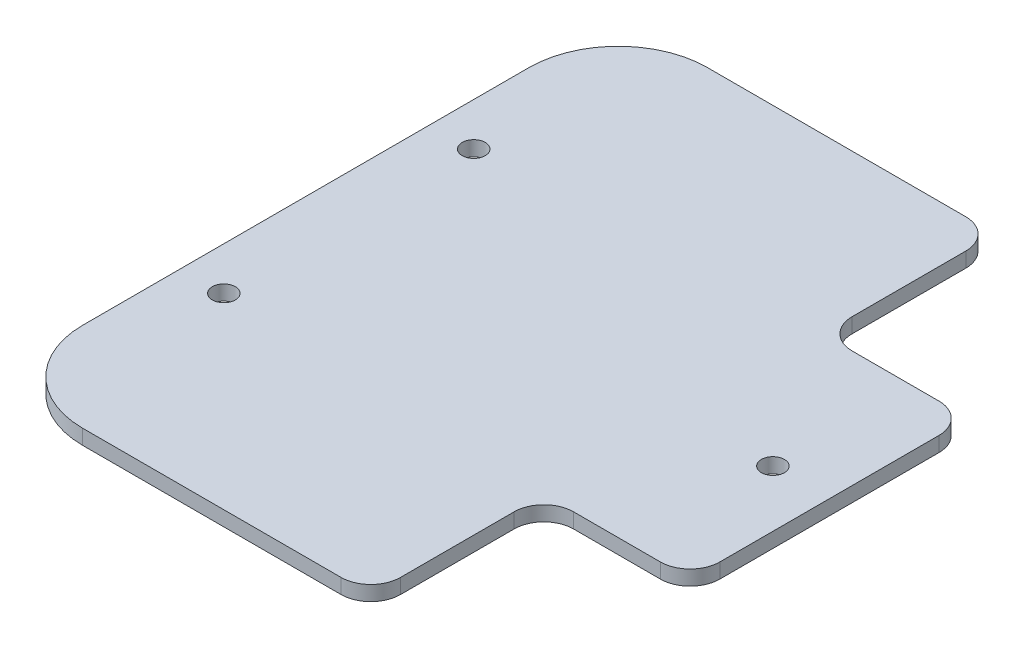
ISO-10303-21;
HEADER;
FILE_DESCRIPTION(('STEP AP214'),'2;1');
FILE_NAME('part.step','',(''),(''),'','','');
FILE_SCHEMA(('AUTOMOTIVE_DESIGN { 1 0 10303 214 1 1 1 1 }'));
ENDSEC;
DATA;
#1=APPLICATION_CONTEXT('core data for automotive mechanical design processes');
#2=APPLICATION_PROTOCOL_DEFINITION('international standard','automotive_design',2000,#1);
#3=PRODUCT_CONTEXT('',#1,'mechanical');
#4=PRODUCT('Part','Part','',(#3));
#5=PRODUCT_RELATED_PRODUCT_CATEGORY('part','',(#4));
#6=PRODUCT_DEFINITION_FORMATION('','',#4);
#7=PRODUCT_DEFINITION_CONTEXT('part definition',#1,'design');
#8=PRODUCT_DEFINITION('design','',#6,#7);
#9=PRODUCT_DEFINITION_SHAPE('','',#8);
#10=(LENGTH_UNIT() NAMED_UNIT(*) SI_UNIT(.MILLI.,.METRE.));
#11=(NAMED_UNIT(*) PLANE_ANGLE_UNIT() SI_UNIT($,.RADIAN.));
#12=(NAMED_UNIT(*) SI_UNIT($,.STERADIAN.) SOLID_ANGLE_UNIT());
#13=UNCERTAINTY_MEASURE_WITH_UNIT(LENGTH_MEASURE(1.E-05),#10,'distance_accuracy_value','');
#14=(GEOMETRIC_REPRESENTATION_CONTEXT(3) GLOBAL_UNCERTAINTY_ASSIGNED_CONTEXT((#13)) GLOBAL_UNIT_ASSIGNED_CONTEXT((#10,
#11,#12)) REPRESENTATION_CONTEXT('',''));
#15=CARTESIAN_POINT('',(0.,0.,0.));
#16=DIRECTION('',(0.,0.,1.));
#17=DIRECTION('',(1.,0.,0.));
#18=AXIS2_PLACEMENT_3D('',#15,#16,#17);
#19=CARTESIAN_POINT('',(54.61,3.175,-23.3854268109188));
#20=DIRECTION('',(0.,-1.,0.));
#21=DIRECTION('',(0.,0.,-1.));
#22=AXIS2_PLACEMENT_3D('',#19,#20,#21);
#23=CYLINDRICAL_SURFACE('',#22,6.35);
#24=CARTESIAN_POINT('',(54.61,0.,-23.3854268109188));
#25=DIRECTION('',(0.,1.,0.));
#26=DIRECTION('',(0.,0.,-1.));
#27=AXIS2_PLACEMENT_3D('',#24,#25,#26);
#28=CIRCLE('',#27,6.35);
#29=CARTESIAN_POINT('',(60.96,0.,-23.3854268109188));
#30=VERTEX_POINT('',#29);
#31=CARTESIAN_POINT('',(54.61,0.,-29.7354268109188));
#32=VERTEX_POINT('',#31);
#33=EDGE_CURVE('E177',#30,#32,#28,.T.);
#34=ORIENTED_EDGE('',*,*,#33,.T.);
#35=DIRECTION('',(0.,-1.,0.));
#36=VECTOR('',#35,1.);
#37=CARTESIAN_POINT('',(54.61,3.175,-29.7354268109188));
#38=LINE('',#37,#36);
#39=CARTESIAN_POINT('',(54.61,3.175,-29.7354268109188));
#40=VERTEX_POINT('',#39);
#41=EDGE_CURVE('E11',#40,#32,#38,.T.);
#42=ORIENTED_EDGE('',*,*,#41,.F.);
#43=CARTESIAN_POINT('',(54.61,3.175,-23.3854268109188));
#44=DIRECTION('',(0.,1.,0.));
#45=DIRECTION('',(0.,0.,-1.));
#46=AXIS2_PLACEMENT_3D('',#43,#44,#45);
#47=CIRCLE('',#46,6.35);
#48=CARTESIAN_POINT('',(60.96,3.175,-23.3854268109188));
#49=VERTEX_POINT('',#48);
#50=EDGE_CURVE('E208',#49,#40,#47,.T.);
#51=ORIENTED_EDGE('',*,*,#50,.F.);
#52=DIRECTION('',(0.,-1.,0.));
#53=VECTOR('',#52,1.);
#54=CARTESIAN_POINT('',(60.96,3.175,-23.3854268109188));
#55=LINE('',#54,#53);
#56=EDGE_CURVE('E173',#49,#30,#55,.T.);
#57=ORIENTED_EDGE('',*,*,#56,.T.);
#58=EDGE_LOOP('',(#34,#42,#51,#57));
#59=FACE_BOUND('',#58,.T.);
#60=ADVANCED_FACE('F33',(#59),#23,.T.);
#61=CARTESIAN_POINT('',(54.61,3.175,-29.7354268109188));
#62=DIRECTION('',(0.,0.,1.));
#63=DIRECTION('',(1.,0.,0.));
#64=AXIS2_PLACEMENT_3D('',#61,#62,#63);
#65=PLANE('',#64);
#66=DIRECTION('',(-1.,0.,0.));
#67=VECTOR('',#66,1.);
#68=CARTESIAN_POINT('',(54.61,0.,-29.7354268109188));
#69=LINE('',#68,#67);
#70=CARTESIAN_POINT('',(36.0854268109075,0.,-29.7354268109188));
#71=VERTEX_POINT('',#70);
#72=EDGE_CURVE('E180',#32,#71,#69,.T.);
#73=ORIENTED_EDGE('',*,*,#72,.T.);
#74=DIRECTION('',(0.,-1.,0.));
#75=VECTOR('',#74,1.);
#76=CARTESIAN_POINT('',(36.0854268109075,3.175,-29.7354268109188));
#77=LINE('',#76,#75);
#78=CARTESIAN_POINT('',(36.0854268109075,3.175,-29.7354268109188));
#79=VERTEX_POINT('',#78);
#80=EDGE_CURVE('E41',#79,#71,#77,.T.);
#81=ORIENTED_EDGE('',*,*,#80,.F.);
#82=DIRECTION('',(-1.,0.,0.));
#83=VECTOR('',#82,1.);
#84=CARTESIAN_POINT('',(54.61,3.175,-29.7354268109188));
#85=LINE('',#84,#83);
#86=EDGE_CURVE('E116',#40,#79,#85,.T.);
#87=ORIENTED_EDGE('',*,*,#86,.F.);
#88=ORIENTED_EDGE('',*,*,#41,.T.);
#89=EDGE_LOOP('',(#73,#81,#87,#88));
#90=FACE_BOUND('',#89,.T.);
#91=ADVANCED_FACE('F307',(#90),#65,.F.);
#92=CARTESIAN_POINT('',(36.0854268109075,3.175,-36.0854268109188));
#93=DIRECTION('',(0.,-1.,0.));
#94=DIRECTION('',(0.,0.,-1.));
#95=AXIS2_PLACEMENT_3D('',#92,#93,#94);
#96=CYLINDRICAL_SURFACE('',#95,6.34999999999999);
#97=CARTESIAN_POINT('',(36.0854268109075,0.,-36.0854268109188));
#98=DIRECTION('',(0.,-1.,0.));
#99=DIRECTION('',(0.,0.,1.));
#100=AXIS2_PLACEMENT_3D('',#97,#98,#99);
#101=CIRCLE('',#100,6.34999999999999);
#102=CARTESIAN_POINT('',(29.7354268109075,0.,-36.0854268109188));
#103=VERTEX_POINT('',#102);
#104=EDGE_CURVE('E183',#71,#103,#101,.T.);
#105=ORIENTED_EDGE('',*,*,#104,.T.);
#106=DIRECTION('',(0.,-1.,0.));
#107=VECTOR('',#106,1.);
#108=CARTESIAN_POINT('',(29.7354268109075,3.175,-36.0854268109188));
#109=LINE('',#108,#107);
#110=CARTESIAN_POINT('',(29.7354268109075,3.175,-36.0854268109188));
#111=VERTEX_POINT('',#110);
#112=EDGE_CURVE('E239',#111,#103,#109,.T.);
#113=ORIENTED_EDGE('',*,*,#112,.F.);
#114=CARTESIAN_POINT('',(36.0854268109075,3.175,-36.0854268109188));
#115=DIRECTION('',(0.,-1.,0.));
#116=DIRECTION('',(0.,0.,1.));
#117=AXIS2_PLACEMENT_3D('',#114,#115,#116);
#118=CIRCLE('',#117,6.34999999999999);
#119=EDGE_CURVE('E247',#79,#111,#118,.T.);
#120=ORIENTED_EDGE('',*,*,#119,.F.);
#121=ORIENTED_EDGE('',*,*,#80,.T.);
#122=EDGE_LOOP('',(#105,#113,#120,#121));
#123=FACE_BOUND('',#122,.T.);
#124=ADVANCED_FACE('F245',(#123),#96,.F.);
#125=CARTESIAN_POINT('',(29.7354268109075,3.175,-36.0854268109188));
#126=DIRECTION('',(-1.,0.,0.));
#127=DIRECTION('',(0.,0.,1.));
#128=AXIS2_PLACEMENT_3D('',#125,#126,#127);
#129=PLANE('',#128);
#130=DIRECTION('',(0.,0.,-1.));
#131=VECTOR('',#130,1.);
#132=CARTESIAN_POINT('',(29.7354268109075,0.,-36.0854268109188));
#133=LINE('',#132,#131);
#134=CARTESIAN_POINT('',(29.7354268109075,0.,-60.325));
#135=VERTEX_POINT('',#134);
#136=EDGE_CURVE('E185',#103,#135,#133,.T.);
#137=ORIENTED_EDGE('',*,*,#136,.T.);
#138=DIRECTION('',(0.,-1.,0.));
#139=VECTOR('',#138,1.);
#140=CARTESIAN_POINT('',(29.7354268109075,3.175,-60.325));
#141=LINE('',#140,#139);
#142=CARTESIAN_POINT('',(29.7354268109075,3.175,-60.325));
#143=VERTEX_POINT('',#142);
#144=EDGE_CURVE('E236',#143,#135,#141,.T.);
#145=ORIENTED_EDGE('',*,*,#144,.F.);
#146=DIRECTION('',(0.,0.,-1.));
#147=VECTOR('',#146,1.);
#148=CARTESIAN_POINT('',(29.7354268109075,3.175,-36.0854268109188));
#149=LINE('',#148,#147);
#150=EDGE_CURVE('E265',#111,#143,#149,.T.);
#151=ORIENTED_EDGE('',*,*,#150,.F.);
#152=ORIENTED_EDGE('',*,*,#112,.T.);
#153=EDGE_LOOP('',(#137,#145,#151,#152));
#154=FACE_BOUND('',#153,.T.);
#155=ADVANCED_FACE('F256',(#154),#129,.F.);
#156=CARTESIAN_POINT('',(23.3854268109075,3.175,-60.325));
#157=DIRECTION('',(0.,-1.,0.));
#158=DIRECTION('',(0.,0.,-1.));
#159=AXIS2_PLACEMENT_3D('',#156,#157,#158);
#160=CYLINDRICAL_SURFACE('',#159,6.35);
#161=CARTESIAN_POINT('',(23.3854268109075,0.,-60.325));
#162=DIRECTION('',(0.,1.,0.));
#163=DIRECTION('',(0.,0.,-1.));
#164=AXIS2_PLACEMENT_3D('',#161,#162,#163);
#165=CIRCLE('',#164,6.35);
#166=CARTESIAN_POINT('',(23.3854268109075,0.,-66.675));
#167=VERTEX_POINT('',#166);
#168=EDGE_CURVE('E187',#135,#167,#165,.T.);
#169=ORIENTED_EDGE('',*,*,#168,.T.);
#170=DIRECTION('',(0.,-1.,0.));
#171=VECTOR('',#170,1.);
#172=CARTESIAN_POINT('',(23.3854268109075,3.175,-66.675));
#173=LINE('',#172,#171);
#174=CARTESIAN_POINT('',(23.3854268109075,3.175,-66.675));
#175=VERTEX_POINT('',#174);
#176=EDGE_CURVE('E233',#175,#167,#173,.T.);
#177=ORIENTED_EDGE('',*,*,#176,.F.);
#178=CARTESIAN_POINT('',(23.3854268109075,3.175,-60.325));
#179=DIRECTION('',(0.,1.,0.));
#180=DIRECTION('',(0.,0.,-1.));
#181=AXIS2_PLACEMENT_3D('',#178,#179,#180);
#182=CIRCLE('',#181,6.35);
#183=EDGE_CURVE('E262',#143,#175,#182,.T.);
#184=ORIENTED_EDGE('',*,*,#183,.F.);
#185=ORIENTED_EDGE('',*,*,#144,.T.);
#186=EDGE_LOOP('',(#169,#177,#184,#185));
#187=FACE_BOUND('',#186,.T.);
#188=ADVANCED_FACE('F260',(#187),#160,.T.);
#189=CARTESIAN_POINT('',(23.3854268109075,3.175,-66.675));
#190=DIRECTION('',(0.,0.,1.));
#191=DIRECTION('',(1.,0.,0.));
#192=AXIS2_PLACEMENT_3D('',#189,#190,#191);
#193=PLANE('',#192);
#194=DIRECTION('',(-1.,0.,0.));
#195=VECTOR('',#194,1.);
#196=CARTESIAN_POINT('',(23.3854268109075,0.,-66.675));
#197=LINE('',#196,#195);
#198=CARTESIAN_POINT('',(-31.75,0.,-66.675));
#199=VERTEX_POINT('',#198);
#200=EDGE_CURVE('E189',#167,#199,#197,.T.);
#201=ORIENTED_EDGE('',*,*,#200,.T.);
#202=DIRECTION('',(0.,-1.,0.));
#203=VECTOR('',#202,1.);
#204=CARTESIAN_POINT('',(-31.75,3.175,-66.675));
#205=LINE('',#204,#203);
#206=CARTESIAN_POINT('',(-31.75,3.175,-66.675));
#207=VERTEX_POINT('',#206);
#208=EDGE_CURVE('E230',#207,#199,#205,.T.);
#209=ORIENTED_EDGE('',*,*,#208,.F.);
#210=DIRECTION('',(-1.,0.,0.));
#211=VECTOR('',#210,1.);
#212=CARTESIAN_POINT('',(23.3854268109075,3.175,-66.675));
#213=LINE('',#212,#211);
#214=EDGE_CURVE('E264',#175,#207,#213,.T.);
#215=ORIENTED_EDGE('',*,*,#214,.F.);
#216=ORIENTED_EDGE('',*,*,#176,.T.);
#217=EDGE_LOOP('',(#201,#209,#215,#216));
#218=FACE_BOUND('',#217,.T.);
#219=ADVANCED_FACE('F320',(#218),#193,.F.);
#220=CARTESIAN_POINT('',(-31.75,3.175,-47.625));
#221=DIRECTION('',(0.,-1.,0.));
#222=DIRECTION('',(0.,0.,-1.));
#223=AXIS2_PLACEMENT_3D('',#220,#221,#222);
#224=CYLINDRICAL_SURFACE('',#223,19.05);
#225=CARTESIAN_POINT('',(-31.75,0.,-47.625));
#226=DIRECTION('',(0.,1.,0.));
#227=DIRECTION('',(0.,0.,1.));
#228=AXIS2_PLACEMENT_3D('',#225,#226,#227);
#229=CIRCLE('',#228,19.05);
#230=CARTESIAN_POINT('',(-50.8,0.,-47.625));
#231=VERTEX_POINT('',#230);
#232=EDGE_CURVE('E191',#199,#231,#229,.T.);
#233=ORIENTED_EDGE('',*,*,#232,.T.);
#234=DIRECTION('',(0.,-1.,0.));
#235=VECTOR('',#234,1.);
#236=CARTESIAN_POINT('',(-50.8,3.175,-47.625));
#237=LINE('',#236,#235);
#238=CARTESIAN_POINT('',(-50.8,3.175,-47.625));
#239=VERTEX_POINT('',#238);
#240=EDGE_CURVE('E227',#239,#231,#237,.T.);
#241=ORIENTED_EDGE('',*,*,#240,.F.);
#242=CARTESIAN_POINT('',(-31.75,3.175,-47.625));
#243=DIRECTION('',(0.,1.,0.));
#244=DIRECTION('',(0.,0.,1.));
#245=AXIS2_PLACEMENT_3D('',#242,#243,#244);
#246=CIRCLE('',#245,19.05);
#247=EDGE_CURVE('E267',#207,#239,#246,.T.);
#248=ORIENTED_EDGE('',*,*,#247,.F.);
#249=ORIENTED_EDGE('',*,*,#208,.T.);
#250=EDGE_LOOP('',(#233,#241,#248,#249));
#251=FACE_BOUND('',#250,.T.);
#252=ADVANCED_FACE('F323',(#251),#224,.T.);
#253=CARTESIAN_POINT('',(-50.8,3.175,-47.625));
#254=DIRECTION('',(1.,0.,0.));
#255=DIRECTION('',(0.,0.,-1.));
#256=AXIS2_PLACEMENT_3D('',#253,#254,#255);
#257=PLANE('',#256);
#258=DIRECTION('',(0.,0.,1.));
#259=VECTOR('',#258,1.);
#260=CARTESIAN_POINT('',(-50.8,0.,-47.625));
#261=LINE('',#260,#259);
#262=CARTESIAN_POINT('',(-50.8,0.,47.625));
#263=VERTEX_POINT('',#262);
#264=EDGE_CURVE('E193',#231,#263,#261,.T.);
#265=ORIENTED_EDGE('',*,*,#264,.T.);
#266=DIRECTION('',(0.,-1.,0.));
#267=VECTOR('',#266,1.);
#268=CARTESIAN_POINT('',(-50.8,3.175,47.625));
#269=LINE('',#268,#267);
#270=CARTESIAN_POINT('',(-50.8,3.175,47.625));
#271=VERTEX_POINT('',#270);
#272=EDGE_CURVE('E224',#271,#263,#269,.T.);
#273=ORIENTED_EDGE('',*,*,#272,.F.);
#274=DIRECTION('',(0.,0.,1.));
#275=VECTOR('',#274,1.);
#276=CARTESIAN_POINT('',(-50.8,3.175,-47.625));
#277=LINE('',#276,#275);
#278=EDGE_CURVE('E273',#239,#271,#277,.T.);
#279=ORIENTED_EDGE('',*,*,#278,.F.);
#280=ORIENTED_EDGE('',*,*,#240,.T.);
#281=EDGE_LOOP('',(#265,#273,#279,#280));
#282=FACE_BOUND('',#281,.T.);
#283=ADVANCED_FACE('F327',(#282),#257,.F.);
#284=CARTESIAN_POINT('',(-31.75,3.175,47.625));
#285=DIRECTION('',(0.,-1.,0.));
#286=DIRECTION('',(0.,0.,-1.));
#287=AXIS2_PLACEMENT_3D('',#284,#285,#286);
#288=CYLINDRICAL_SURFACE('',#287,19.05);
#289=CARTESIAN_POINT('',(-31.75,0.,47.625));
#290=DIRECTION('',(0.,1.,0.));
#291=DIRECTION('',(0.,0.,1.));
#292=AXIS2_PLACEMENT_3D('',#289,#290,#291);
#293=CIRCLE('',#292,19.05);
#294=CARTESIAN_POINT('',(-31.75,0.,66.675));
#295=VERTEX_POINT('',#294);
#296=EDGE_CURVE('E195',#263,#295,#293,.T.);
#297=ORIENTED_EDGE('',*,*,#296,.T.);
#298=DIRECTION('',(0.,-1.,0.));
#299=VECTOR('',#298,1.);
#300=CARTESIAN_POINT('',(-31.75,3.175,66.675));
#301=LINE('',#300,#299);
#302=CARTESIAN_POINT('',(-31.75,3.175,66.675));
#303=VERTEX_POINT('',#302);
#304=EDGE_CURVE('E221',#303,#295,#301,.T.);
#305=ORIENTED_EDGE('',*,*,#304,.F.);
#306=CARTESIAN_POINT('',(-31.75,3.175,47.625));
#307=DIRECTION('',(0.,1.,0.));
#308=DIRECTION('',(0.,0.,1.));
#309=AXIS2_PLACEMENT_3D('',#306,#307,#308);
#310=CIRCLE('',#309,19.05);
#311=EDGE_CURVE('E275',#271,#303,#310,.T.);
#312=ORIENTED_EDGE('',*,*,#311,.F.);
#313=ORIENTED_EDGE('',*,*,#272,.T.);
#314=EDGE_LOOP('',(#297,#305,#312,#313));
#315=FACE_BOUND('',#314,.T.);
#316=ADVANCED_FACE('F331',(#315),#288,.T.);
#317=CARTESIAN_POINT('',(23.3854268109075,3.175,66.675));
#318=DIRECTION('',(0.,0.,-1.));
#319=DIRECTION('',(-1.,0.,0.));
#320=AXIS2_PLACEMENT_3D('',#317,#318,#319);
#321=PLANE('',#320);
#322=DIRECTION('',(1.,0.,0.));
#323=VECTOR('',#322,1.);
#324=CARTESIAN_POINT('',(23.3854268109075,0.,66.675));
#325=LINE('',#324,#323);
#326=CARTESIAN_POINT('',(23.3854268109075,0.,66.675));
#327=VERTEX_POINT('',#326);
#328=EDGE_CURVE('E197',#295,#327,#325,.T.);
#329=ORIENTED_EDGE('',*,*,#328,.T.);
#330=DIRECTION('',(0.,-1.,0.));
#331=VECTOR('',#330,1.);
#332=CARTESIAN_POINT('',(23.3854268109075,3.175,66.675));
#333=LINE('',#332,#331);
#334=CARTESIAN_POINT('',(23.3854268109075,3.175,66.675));
#335=VERTEX_POINT('',#334);
#336=EDGE_CURVE('E218',#335,#327,#333,.T.);
#337=ORIENTED_EDGE('',*,*,#336,.F.);
#338=DIRECTION('',(1.,0.,0.));
#339=VECTOR('',#338,1.);
#340=CARTESIAN_POINT('',(23.3854268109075,3.175,66.675));
#341=LINE('',#340,#339);
#342=EDGE_CURVE('E277',#303,#335,#341,.T.);
#343=ORIENTED_EDGE('',*,*,#342,.F.);
#344=ORIENTED_EDGE('',*,*,#304,.T.);
#345=EDGE_LOOP('',(#329,#337,#343,#344));
#346=FACE_BOUND('',#345,.T.);
#347=ADVANCED_FACE('F335',(#346),#321,.F.);
#348=CARTESIAN_POINT('',(23.3854268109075,3.175,60.325));
#349=DIRECTION('',(0.,-1.,0.));
#350=DIRECTION('',(0.,0.,-1.));
#351=AXIS2_PLACEMENT_3D('',#348,#349,#350);
#352=CYLINDRICAL_SURFACE('',#351,6.35);
#353=CARTESIAN_POINT('',(23.3854268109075,0.,60.325));
#354=DIRECTION('',(0.,1.,0.));
#355=DIRECTION('',(0.,0.,-1.));
#356=AXIS2_PLACEMENT_3D('',#353,#354,#355);
#357=CIRCLE('',#356,6.35);
#358=CARTESIAN_POINT('',(29.7354268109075,0.,60.325));
#359=VERTEX_POINT('',#358);
#360=EDGE_CURVE('E199',#327,#359,#357,.T.);
#361=ORIENTED_EDGE('',*,*,#360,.T.);
#362=DIRECTION('',(0.,-1.,0.));
#363=VECTOR('',#362,1.);
#364=CARTESIAN_POINT('',(29.7354268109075,3.175,60.325));
#365=LINE('',#364,#363);
#366=CARTESIAN_POINT('',(29.7354268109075,3.175,60.325));
#367=VERTEX_POINT('',#366);
#368=EDGE_CURVE('E215',#367,#359,#365,.T.);
#369=ORIENTED_EDGE('',*,*,#368,.F.);
#370=CARTESIAN_POINT('',(23.3854268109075,3.175,60.325));
#371=DIRECTION('',(0.,1.,0.));
#372=DIRECTION('',(0.,0.,-1.));
#373=AXIS2_PLACEMENT_3D('',#370,#371,#372);
#374=CIRCLE('',#373,6.35);
#375=EDGE_CURVE('E279',#335,#367,#374,.T.);
#376=ORIENTED_EDGE('',*,*,#375,.F.);
#377=ORIENTED_EDGE('',*,*,#336,.T.);
#378=EDGE_LOOP('',(#361,#369,#376,#377));
#379=FACE_BOUND('',#378,.T.);
#380=ADVANCED_FACE('F339',(#379),#352,.T.);
#381=CARTESIAN_POINT('',(29.7354268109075,3.175,36.0854268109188));
#382=DIRECTION('',(-1.,0.,0.));
#383=DIRECTION('',(0.,0.,1.));
#384=AXIS2_PLACEMENT_3D('',#381,#382,#383);
#385=PLANE('',#384);
#386=DIRECTION('',(0.,0.,-1.));
#387=VECTOR('',#386,1.);
#388=CARTESIAN_POINT('',(29.7354268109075,0.,36.0854268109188));
#389=LINE('',#388,#387);
#390=CARTESIAN_POINT('',(29.7354268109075,0.,36.0854268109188));
#391=VERTEX_POINT('',#390);
#392=EDGE_CURVE('E201',#359,#391,#389,.T.);
#393=ORIENTED_EDGE('',*,*,#392,.T.);
#394=DIRECTION('',(0.,-1.,0.));
#395=VECTOR('',#394,1.);
#396=CARTESIAN_POINT('',(29.7354268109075,3.175,36.0854268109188));
#397=LINE('',#396,#395);
#398=CARTESIAN_POINT('',(29.7354268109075,3.175,36.0854268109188));
#399=VERTEX_POINT('',#398);
#400=EDGE_CURVE('E212',#399,#391,#397,.T.);
#401=ORIENTED_EDGE('',*,*,#400,.F.);
#402=DIRECTION('',(0.,0.,-1.));
#403=VECTOR('',#402,1.);
#404=CARTESIAN_POINT('',(29.7354268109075,3.175,36.0854268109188));
#405=LINE('',#404,#403);
#406=EDGE_CURVE('E281',#367,#399,#405,.T.);
#407=ORIENTED_EDGE('',*,*,#406,.F.);
#408=ORIENTED_EDGE('',*,*,#368,.T.);
#409=EDGE_LOOP('',(#393,#401,#407,#408));
#410=FACE_BOUND('',#409,.T.);
#411=ADVANCED_FACE('F287',(#410),#385,.F.);
#412=CARTESIAN_POINT('',(36.0854268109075,3.175,36.0854268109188));
#413=DIRECTION('',(0.,-1.,0.));
#414=DIRECTION('',(0.,0.,-1.));
#415=AXIS2_PLACEMENT_3D('',#412,#413,#414);
#416=CYLINDRICAL_SURFACE('',#415,6.34999999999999);
#417=CARTESIAN_POINT('',(36.0854268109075,0.,36.0854268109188));
#418=DIRECTION('',(0.,-1.,0.));
#419=DIRECTION('',(0.,0.,-1.));
#420=AXIS2_PLACEMENT_3D('',#417,#418,#419);
#421=CIRCLE('',#420,6.34999999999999);
#422=CARTESIAN_POINT('',(36.0854268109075,0.,29.7354268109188));
#423=VERTEX_POINT('',#422);
#424=EDGE_CURVE('E203',#391,#423,#421,.T.);
#425=ORIENTED_EDGE('',*,*,#424,.T.);
#426=DIRECTION('',(0.,-1.,0.));
#427=VECTOR('',#426,1.);
#428=CARTESIAN_POINT('',(36.0854268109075,3.175,29.7354268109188));
#429=LINE('',#428,#427);
#430=CARTESIAN_POINT('',(36.0854268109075,3.175,29.7354268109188));
#431=VERTEX_POINT('',#430);
#432=EDGE_CURVE('E168',#431,#423,#429,.T.);
#433=ORIENTED_EDGE('',*,*,#432,.F.);
#434=CARTESIAN_POINT('',(36.0854268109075,3.175,36.0854268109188));
#435=DIRECTION('',(0.,-1.,0.));
#436=DIRECTION('',(0.,0.,-1.));
#437=AXIS2_PLACEMENT_3D('',#434,#435,#436);
#438=CIRCLE('',#437,6.34999999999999);
#439=EDGE_CURVE('E159',#399,#431,#438,.T.);
#440=ORIENTED_EDGE('',*,*,#439,.F.);
#441=ORIENTED_EDGE('',*,*,#400,.T.);
#442=EDGE_LOOP('',(#425,#433,#440,#441));
#443=FACE_BOUND('',#442,.T.);
#444=ADVANCED_FACE('F291',(#443),#416,.F.);
#445=CARTESIAN_POINT('',(54.61,3.175,29.7354268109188));
#446=DIRECTION('',(0.,0.,-1.));
#447=DIRECTION('',(-1.,0.,0.));
#448=AXIS2_PLACEMENT_3D('',#445,#446,#447);
#449=PLANE('',#448);
#450=DIRECTION('',(1.,0.,0.));
#451=VECTOR('',#450,1.);
#452=CARTESIAN_POINT('',(54.61,0.,29.7354268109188));
#453=LINE('',#452,#451);
#454=CARTESIAN_POINT('',(54.61,0.,29.7354268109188));
#455=VERTEX_POINT('',#454);
#456=EDGE_CURVE('E167',#423,#455,#453,.T.);
#457=ORIENTED_EDGE('',*,*,#456,.T.);
#458=DIRECTION('',(0.,-1.,0.));
#459=VECTOR('',#458,1.);
#460=CARTESIAN_POINT('',(54.61,3.175,29.7354268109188));
#461=LINE('',#460,#459);
#462=CARTESIAN_POINT('',(54.61,3.175,29.7354268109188));
#463=VERTEX_POINT('',#462);
#464=EDGE_CURVE('E164',#463,#455,#461,.T.);
#465=ORIENTED_EDGE('',*,*,#464,.F.);
#466=DIRECTION('',(1.,0.,0.));
#467=VECTOR('',#466,1.);
#468=CARTESIAN_POINT('',(54.61,3.175,29.7354268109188));
#469=LINE('',#468,#467);
#470=EDGE_CURVE('E153',#431,#463,#469,.T.);
#471=ORIENTED_EDGE('',*,*,#470,.F.);
#472=ORIENTED_EDGE('',*,*,#432,.T.);
#473=EDGE_LOOP('',(#457,#465,#471,#472));
#474=FACE_BOUND('',#473,.T.);
#475=ADVANCED_FACE('F165',(#474),#449,.F.);
#476=CARTESIAN_POINT('',(54.61,3.175,23.3854268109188));
#477=DIRECTION('',(0.,-1.,0.));
#478=DIRECTION('',(0.,0.,-1.));
#479=AXIS2_PLACEMENT_3D('',#476,#477,#478);
#480=CYLINDRICAL_SURFACE('',#479,6.35);
#481=CARTESIAN_POINT('',(54.61,0.,23.3854268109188));
#482=DIRECTION('',(0.,1.,0.));
#483=DIRECTION('',(0.,0.,-1.));
#484=AXIS2_PLACEMENT_3D('',#481,#482,#483);
#485=CIRCLE('',#484,6.35);
#486=CARTESIAN_POINT('',(60.96,0.,23.3854268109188));
#487=VERTEX_POINT('',#486);
#488=EDGE_CURVE('E102',#455,#487,#485,.T.);
#489=ORIENTED_EDGE('',*,*,#488,.T.);
#490=DIRECTION('',(0.,-1.,0.));
#491=VECTOR('',#490,1.);
#492=CARTESIAN_POINT('',(60.96,3.175,23.3854268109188));
#493=LINE('',#492,#491);
#494=CARTESIAN_POINT('',(60.96,3.175,23.3854268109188));
#495=VERTEX_POINT('',#494);
#496=EDGE_CURVE('E169',#495,#487,#493,.T.);
#497=ORIENTED_EDGE('',*,*,#496,.F.);
#498=CARTESIAN_POINT('',(54.61,3.175,23.3854268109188));
#499=DIRECTION('',(0.,1.,0.));
#500=DIRECTION('',(0.,0.,-1.));
#501=AXIS2_PLACEMENT_3D('',#498,#499,#500);
#502=CIRCLE('',#501,6.35);
#503=EDGE_CURVE('E157',#463,#495,#502,.T.);
#504=ORIENTED_EDGE('',*,*,#503,.F.);
#505=ORIENTED_EDGE('',*,*,#464,.T.);
#506=EDGE_LOOP('',(#489,#497,#504,#505));
#507=FACE_BOUND('',#506,.T.);
#508=ADVANCED_FACE('F171',(#507),#480,.T.);
#509=CARTESIAN_POINT('',(60.96,3.175,-23.3854268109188));
#510=DIRECTION('',(-1.,0.,0.));
#511=DIRECTION('',(0.,0.,1.));
#512=AXIS2_PLACEMENT_3D('',#509,#510,#511);
#513=PLANE('',#512);
#514=DIRECTION('',(0.,0.,-1.));
#515=VECTOR('',#514,1.);
#516=CARTESIAN_POINT('',(60.96,0.,-23.3854268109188));
#517=LINE('',#516,#515);
#518=EDGE_CURVE('E108',#487,#30,#517,.T.);
#519=ORIENTED_EDGE('',*,*,#518,.T.);
#520=ORIENTED_EDGE('',*,*,#56,.F.);
#521=DIRECTION('',(0.,0.,-1.));
#522=VECTOR('',#521,1.);
#523=CARTESIAN_POINT('',(60.96,3.175,-23.3854268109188));
#524=LINE('',#523,#522);
#525=EDGE_CURVE('E49',#495,#49,#524,.T.);
#526=ORIENTED_EDGE('',*,*,#525,.F.);
#527=ORIENTED_EDGE('',*,*,#496,.T.);
#528=EDGE_LOOP('',(#519,#520,#526,#527));
#529=FACE_BOUND('',#528,.T.);
#530=ADVANCED_FACE('F295',(#529),#513,.F.);
#531=CARTESIAN_POINT('',(54.61,3.175,-23.3854268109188));
#532=DIRECTION('',(0.,-1.,0.));
#533=DIRECTION('',(0.,0.,-1.));
#534=AXIS2_PLACEMENT_3D('',#531,#532,#533);
#535=PLANE('',#534);
#536=CARTESIAN_POINT('',(48.8950000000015,3.175,0.));
#537=DIRECTION('',(0.,1.,0.));
#538=DIRECTION('',(0.,0.,1.));
#539=AXIS2_PLACEMENT_3D('',#536,#537,#538);
#540=CIRCLE('',#539,2.45744999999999);
#541=CARTESIAN_POINT('',(48.8950000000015,3.175,2.45744999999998));
#542=VERTEX_POINT('',#541);
#543=EDGE_CURVE('E415',#542,#542,#540,.T.);
#544=ORIENTED_EDGE('',*,*,#543,.F.);
#545=EDGE_LOOP('',(#544));
#546=FACE_BOUND('',#545,.T.);
#547=CARTESIAN_POINT('',(-41.635551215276,3.175,-26.6699999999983));
#548=DIRECTION('',(0.,1.,0.));
#549=DIRECTION('',(0.,0.,1.));
#550=AXIS2_PLACEMENT_3D('',#547,#548,#549);
#551=CIRCLE('',#550,2.45744999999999);
#552=CARTESIAN_POINT('',(-41.635551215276,3.175,-24.2125499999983));
#553=VERTEX_POINT('',#552);
#554=EDGE_CURVE('E417',#553,#553,#551,.T.);
#555=ORIENTED_EDGE('',*,*,#554,.F.);
#556=EDGE_LOOP('',(#555));
#557=FACE_BOUND('',#556,.T.);
#558=CARTESIAN_POINT('',(-41.635551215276,3.175,26.6699999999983));
#559=DIRECTION('',(0.,1.,0.));
#560=DIRECTION('',(0.,0.,1.));
#561=AXIS2_PLACEMENT_3D('',#558,#559,#560);
#562=CIRCLE('',#561,2.45744999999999);
#563=CARTESIAN_POINT('',(-41.635551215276,3.175,29.1274499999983));
#564=VERTEX_POINT('',#563);
#565=EDGE_CURVE('E425',#564,#564,#562,.T.);
#566=ORIENTED_EDGE('',*,*,#565,.F.);
#567=EDGE_LOOP('',(#566));
#568=FACE_BOUND('',#567,.T.);
#569=ORIENTED_EDGE('',*,*,#50,.T.);
#570=ORIENTED_EDGE('',*,*,#86,.T.);
#571=ORIENTED_EDGE('',*,*,#119,.T.);
#572=ORIENTED_EDGE('',*,*,#150,.T.);
#573=ORIENTED_EDGE('',*,*,#183,.T.);
#574=ORIENTED_EDGE('',*,*,#214,.T.);
#575=ORIENTED_EDGE('',*,*,#247,.T.);
#576=ORIENTED_EDGE('',*,*,#278,.T.);
#577=ORIENTED_EDGE('',*,*,#311,.T.);
#578=ORIENTED_EDGE('',*,*,#342,.T.);
#579=ORIENTED_EDGE('',*,*,#375,.T.);
#580=ORIENTED_EDGE('',*,*,#406,.T.);
#581=ORIENTED_EDGE('',*,*,#439,.T.);
#582=ORIENTED_EDGE('',*,*,#470,.T.);
#583=ORIENTED_EDGE('',*,*,#503,.T.);
#584=ORIENTED_EDGE('',*,*,#525,.T.);
#585=EDGE_LOOP('',(#569,#570,#571,#572,#573,#574,#575,#576,#577,#578,#579,#580,#581,#582,#583,#584));
#586=FACE_BOUND('',#585,.T.);
#587=ADVANCED_FACE('F155',(#546,#557,#568,#586),#535,.F.);
#588=CARTESIAN_POINT('',(54.61,0.,-23.3854268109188));
#589=DIRECTION('',(0.,-1.,0.));
#590=DIRECTION('',(0.,0.,-1.));
#591=AXIS2_PLACEMENT_3D('',#588,#589,#590);
#592=PLANE('',#591);
#593=CARTESIAN_POINT('',(48.8950000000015,0.,0.));
#594=DIRECTION('',(0.,1.,0.));
#595=DIRECTION('',(0.,0.,1.));
#596=AXIS2_PLACEMENT_3D('',#593,#594,#595);
#597=CIRCLE('',#596,2.45745);
#598=CARTESIAN_POINT('',(48.8950000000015,0.,2.45744999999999));
#599=VERTEX_POINT('',#598);
#600=EDGE_CURVE('E412',#599,#599,#597,.T.);
#601=ORIENTED_EDGE('',*,*,#600,.T.);
#602=EDGE_LOOP('',(#601));
#603=FACE_BOUND('',#602,.T.);
#604=CARTESIAN_POINT('',(-41.635551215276,0.,-26.6699999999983));
#605=DIRECTION('',(0.,1.,0.));
#606=DIRECTION('',(0.,0.,1.));
#607=AXIS2_PLACEMENT_3D('',#604,#605,#606);
#608=CIRCLE('',#607,2.45745);
#609=CARTESIAN_POINT('',(-41.635551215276,0.,-24.2125499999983));
#610=VERTEX_POINT('',#609);
#611=EDGE_CURVE('E422',#610,#610,#608,.T.);
#612=ORIENTED_EDGE('',*,*,#611,.T.);
#613=EDGE_LOOP('',(#612));
#614=FACE_BOUND('',#613,.T.);
#615=CARTESIAN_POINT('',(-41.635551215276,0.,26.6699999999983));
#616=DIRECTION('',(0.,1.,0.));
#617=DIRECTION('',(0.,0.,1.));
#618=AXIS2_PLACEMENT_3D('',#615,#616,#617);
#619=CIRCLE('',#618,2.45745);
#620=CARTESIAN_POINT('',(-41.635551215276,0.,29.1274499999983));
#621=VERTEX_POINT('',#620);
#622=EDGE_CURVE('E181',#621,#621,#619,.T.);
#623=ORIENTED_EDGE('',*,*,#622,.T.);
#624=EDGE_LOOP('',(#623));
#625=FACE_BOUND('',#624,.T.);
#626=ORIENTED_EDGE('',*,*,#33,.F.);
#627=ORIENTED_EDGE('',*,*,#518,.F.);
#628=ORIENTED_EDGE('',*,*,#488,.F.);
#629=ORIENTED_EDGE('',*,*,#456,.F.);
#630=ORIENTED_EDGE('',*,*,#424,.F.);
#631=ORIENTED_EDGE('',*,*,#392,.F.);
#632=ORIENTED_EDGE('',*,*,#360,.F.);
#633=ORIENTED_EDGE('',*,*,#328,.F.);
#634=ORIENTED_EDGE('',*,*,#296,.F.);
#635=ORIENTED_EDGE('',*,*,#264,.F.);
#636=ORIENTED_EDGE('',*,*,#232,.F.);
#637=ORIENTED_EDGE('',*,*,#200,.F.);
#638=ORIENTED_EDGE('',*,*,#168,.F.);
#639=ORIENTED_EDGE('',*,*,#136,.F.);
#640=ORIENTED_EDGE('',*,*,#104,.F.);
#641=ORIENTED_EDGE('',*,*,#72,.F.);
#642=EDGE_LOOP('',(#626,#627,#628,#629,#630,#631,#632,#633,#634,#635,#636,#637,#638,#639,#640,#641));
#643=FACE_BOUND('',#642,.T.);
#644=ADVANCED_FACE('F251',(#603,#614,#625,#643),#592,.T.);
#645=CARTESIAN_POINT('',(-41.635551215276,3.175,26.6699999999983));
#646=DIRECTION('',(0.,1.,0.));
#647=DIRECTION('',(0.,0.,1.));
#648=AXIS2_PLACEMENT_3D('',#645,#646,#647);
#649=CYLINDRICAL_SURFACE('',#648,2.45744999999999);
#650=ORIENTED_EDGE('',*,*,#622,.F.);
#651=EDGE_LOOP('',(#650));
#652=FACE_BOUND('',#651,.T.);
#653=ORIENTED_EDGE('',*,*,#565,.T.);
#654=EDGE_LOOP('',(#653));
#655=FACE_BOUND('',#654,.T.);
#656=ADVANCED_FACE('F376',(#652,#655),#649,.F.);
#657=CARTESIAN_POINT('',(-41.635551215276,3.175,-26.6699999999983));
#658=DIRECTION('',(0.,1.,0.));
#659=DIRECTION('',(0.,0.,1.));
#660=AXIS2_PLACEMENT_3D('',#657,#658,#659);
#661=CYLINDRICAL_SURFACE('',#660,2.45744999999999);
#662=ORIENTED_EDGE('',*,*,#611,.F.);
#663=EDGE_LOOP('',(#662));
#664=FACE_BOUND('',#663,.T.);
#665=ORIENTED_EDGE('',*,*,#554,.T.);
#666=EDGE_LOOP('',(#665));
#667=FACE_BOUND('',#666,.T.);
#668=ADVANCED_FACE('F385',(#664,#667),#661,.F.);
#669=CARTESIAN_POINT('',(48.8950000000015,3.175,0.));
#670=DIRECTION('',(0.,1.,0.));
#671=DIRECTION('',(0.,0.,1.));
#672=AXIS2_PLACEMENT_3D('',#669,#670,#671);
#673=CYLINDRICAL_SURFACE('',#672,2.45744999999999);
#674=ORIENTED_EDGE('',*,*,#600,.F.);
#675=EDGE_LOOP('',(#674));
#676=FACE_BOUND('',#675,.T.);
#677=ORIENTED_EDGE('',*,*,#543,.T.);
#678=EDGE_LOOP('',(#677));
#679=FACE_BOUND('',#678,.T.);
#680=ADVANCED_FACE('F395',(#676,#679),#673,.F.);
#681=CLOSED_SHELL('',(#60,#91,#124,#155,#188,#219,#252,#283,#316,#347,#380,#411,#444,#475,#508,
#530,#587,#644,#656,#668,#680));
#682=MANIFOLD_SOLID_BREP('B2',#681);
#683=ADVANCED_BREP_SHAPE_REPRESENTATION('',(#18,#682),#14);
#684=SHAPE_DEFINITION_REPRESENTATION(#9,#683);
ENDSEC;
END-ISO-10303-21;
